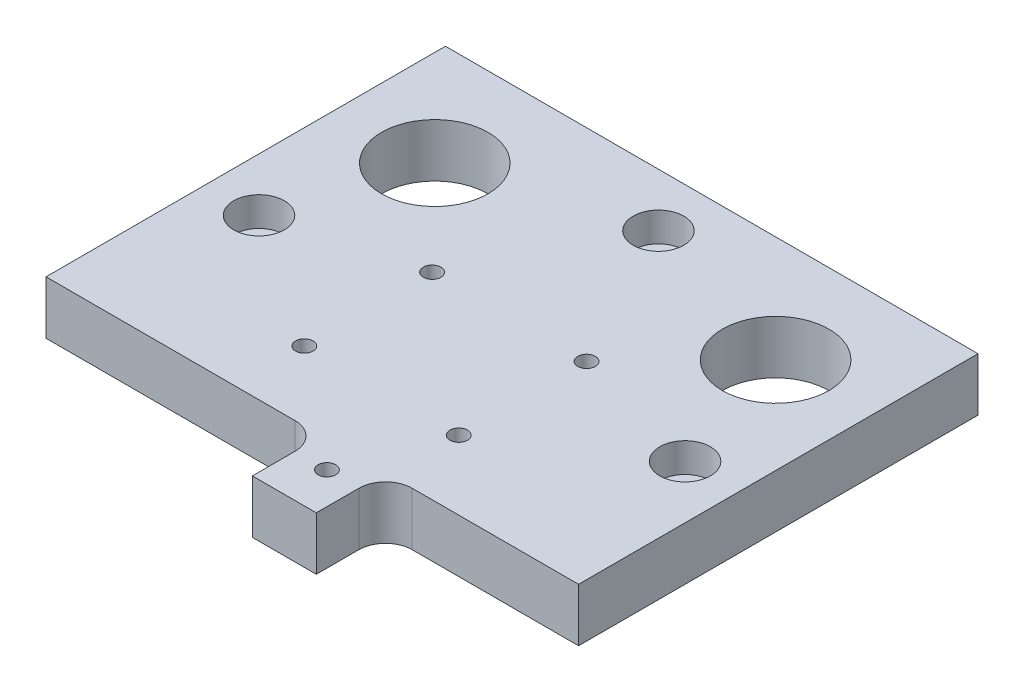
ISO-10303-21;
HEADER;
FILE_DESCRIPTION(('STEP AP214'),'2;1');
FILE_NAME('part.step','',(''),(''),'','','');
FILE_SCHEMA(('AUTOMOTIVE_DESIGN { 1 0 10303 214 1 1 1 1 }'));
ENDSEC;
DATA;
#1=APPLICATION_CONTEXT('core data for automotive mechanical design processes');
#2=APPLICATION_PROTOCOL_DEFINITION('international standard','automotive_design',2000,#1);
#3=PRODUCT_CONTEXT('',#1,'mechanical');
#4=PRODUCT('Part','Part','',(#3));
#5=PRODUCT_RELATED_PRODUCT_CATEGORY('part','',(#4));
#6=PRODUCT_DEFINITION_FORMATION('','',#4);
#7=PRODUCT_DEFINITION_CONTEXT('part definition',#1,'design');
#8=PRODUCT_DEFINITION('design','',#6,#7);
#9=PRODUCT_DEFINITION_SHAPE('','',#8);
#10=(LENGTH_UNIT() NAMED_UNIT(*) SI_UNIT(.MILLI.,.METRE.));
#11=(NAMED_UNIT(*) PLANE_ANGLE_UNIT() SI_UNIT($,.RADIAN.));
#12=(NAMED_UNIT(*) SI_UNIT($,.STERADIAN.) SOLID_ANGLE_UNIT());
#13=UNCERTAINTY_MEASURE_WITH_UNIT(LENGTH_MEASURE(1.E-05),#10,'distance_accuracy_value','');
#14=(GEOMETRIC_REPRESENTATION_CONTEXT(3) GLOBAL_UNCERTAINTY_ASSIGNED_CONTEXT((#13)) GLOBAL_UNIT_ASSIGNED_CONTEXT((#10,
#11,#12)) REPRESENTATION_CONTEXT('',''));
#15=CARTESIAN_POINT('',(0.,0.,0.));
#16=DIRECTION('',(0.,0.,1.));
#17=DIRECTION('',(1.,0.,0.));
#18=AXIS2_PLACEMENT_3D('',#15,#16,#17);
#19=CARTESIAN_POINT('',(90.,-78.,45.));
#20=DIRECTION('',(0.,1.,0.));
#21=DIRECTION('',(0.,0.,1.));
#22=AXIS2_PLACEMENT_3D('',#19,#20,#21);
#23=CYLINDRICAL_SURFACE('',#22,2.75);
#24=CARTESIAN_POINT('',(90.,0.,45.));
#25=DIRECTION('',(0.,1.,0.));
#26=DIRECTION('',(0.,0.,1.));
#27=AXIS2_PLACEMENT_3D('',#24,#25,#26);
#28=CIRCLE('',#27,2.75);
#29=CARTESIAN_POINT('',(90.,0.,47.75));
#30=VERTEX_POINT('',#29);
#31=EDGE_CURVE('E195',#30,#30,#28,.T.);
#32=ORIENTED_EDGE('',*,*,#31,.F.);
#33=EDGE_LOOP('',(#32));
#34=FACE_BOUND('',#33,.T.);
#35=CARTESIAN_POINT('',(90.,4.5,45.));
#36=DIRECTION('',(0.,1.,0.));
#37=DIRECTION('',(0.,0.,1.));
#38=AXIS2_PLACEMENT_3D('',#35,#36,#37);
#39=CIRCLE('',#38,2.75);
#40=CARTESIAN_POINT('',(90.,4.5,47.75));
#41=VERTEX_POINT('',#40);
#42=EDGE_CURVE('E37',#41,#41,#39,.F.);
#43=ORIENTED_EDGE('',*,*,#42,.F.);
#44=EDGE_LOOP('',(#43));
#45=FACE_BOUND('',#44,.T.);
#46=ADVANCED_FACE('F33',(#34,#45),#23,.F.);
#47=CARTESIAN_POINT('',(10.,-78.,45.));
#48=DIRECTION('',(0.,1.,0.));
#49=DIRECTION('',(0.,0.,1.));
#50=AXIS2_PLACEMENT_3D('',#47,#48,#49);
#51=CYLINDRICAL_SURFACE('',#50,2.75);
#52=CARTESIAN_POINT('',(10.,0.,45.));
#53=DIRECTION('',(0.,1.,0.));
#54=DIRECTION('',(0.,0.,1.));
#55=AXIS2_PLACEMENT_3D('',#52,#53,#54);
#56=CIRCLE('',#55,2.75);
#57=CARTESIAN_POINT('',(10.,0.,47.75));
#58=VERTEX_POINT('',#57);
#59=EDGE_CURVE('E198',#58,#58,#56,.T.);
#60=ORIENTED_EDGE('',*,*,#59,.F.);
#61=EDGE_LOOP('',(#60));
#62=FACE_BOUND('',#61,.T.);
#63=CARTESIAN_POINT('',(10.,4.5,45.));
#64=DIRECTION('',(0.,1.,0.));
#65=DIRECTION('',(0.,0.,1.));
#66=AXIS2_PLACEMENT_3D('',#63,#64,#65);
#67=CIRCLE('',#66,2.75);
#68=CARTESIAN_POINT('',(10.,4.5,47.75));
#69=VERTEX_POINT('',#68);
#70=EDGE_CURVE('E246',#69,#69,#67,.F.);
#71=ORIENTED_EDGE('',*,*,#70,.F.);
#72=EDGE_LOOP('',(#71));
#73=FACE_BOUND('',#72,.T.);
#74=ADVANCED_FACE('F341',(#62,#73),#51,.F.);
#75=CARTESIAN_POINT('',(50.,-78.,10.));
#76=DIRECTION('',(0.,1.,0.));
#77=DIRECTION('',(0.,0.,1.));
#78=AXIS2_PLACEMENT_3D('',#75,#76,#77);
#79=CYLINDRICAL_SURFACE('',#78,2.75);
#80=CARTESIAN_POINT('',(50.,0.,10.));
#81=DIRECTION('',(0.,1.,0.));
#82=DIRECTION('',(0.,0.,1.));
#83=AXIS2_PLACEMENT_3D('',#80,#81,#82);
#84=CIRCLE('',#83,2.75);
#85=CARTESIAN_POINT('',(50.,0.,12.75));
#86=VERTEX_POINT('',#85);
#87=EDGE_CURVE('E201',#86,#86,#84,.T.);
#88=ORIENTED_EDGE('',*,*,#87,.F.);
#89=EDGE_LOOP('',(#88));
#90=FACE_BOUND('',#89,.T.);
#91=CARTESIAN_POINT('',(50.,4.5,10.));
#92=DIRECTION('',(0.,1.,0.));
#93=DIRECTION('',(0.,0.,1.));
#94=AXIS2_PLACEMENT_3D('',#91,#92,#93);
#95=CIRCLE('',#94,2.75);
#96=CARTESIAN_POINT('',(50.,4.5,12.75));
#97=VERTEX_POINT('',#96);
#98=EDGE_CURVE('E137',#97,#97,#95,.F.);
#99=ORIENTED_EDGE('',*,*,#98,.F.);
#100=EDGE_LOOP('',(#99));
#101=FACE_BOUND('',#100,.T.);
#102=ADVANCED_FACE('F347',(#90,#101),#79,.F.);
#103=CARTESIAN_POINT('',(0.,0.,88.));
#104=DIRECTION('',(1.,0.,0.));
#105=DIRECTION('',(0.,0.,-1.));
#106=AXIS2_PLACEMENT_3D('',#103,#104,#105);
#107=PLANE('',#106);
#108=DIRECTION('',(0.,1.,0.));
#109=VECTOR('',#108,1.);
#110=CARTESIAN_POINT('',(0.,-78.,75.));
#111=LINE('',#110,#109);
#112=CARTESIAN_POINT('',(0.,0.,75.));
#113=VERTEX_POINT('',#112);
#114=CARTESIAN_POINT('',(0.,10.,75.));
#115=VERTEX_POINT('',#114);
#116=EDGE_CURVE('E122',#113,#115,#111,.T.);
#117=ORIENTED_EDGE('',*,*,#116,.T.);
#118=DIRECTION('',(0.,0.,-1.));
#119=VECTOR('',#118,1.);
#120=CARTESIAN_POINT('',(0.,10.,88.));
#121=LINE('',#120,#119);
#122=CARTESIAN_POINT('',(0.,10.,0.));
#123=VERTEX_POINT('',#122);
#124=EDGE_CURVE('E136',#115,#123,#121,.T.);
#125=ORIENTED_EDGE('',*,*,#124,.T.);
#126=DIRECTION('',(0.,-1.,0.));
#127=VECTOR('',#126,1.);
#128=CARTESIAN_POINT('',(0.,0.,0.));
#129=LINE('',#128,#127);
#130=CARTESIAN_POINT('',(0.,0.,0.));
#131=VERTEX_POINT('',#130);
#132=EDGE_CURVE('E222',#123,#131,#129,.T.);
#133=ORIENTED_EDGE('',*,*,#132,.T.);
#134=DIRECTION('',(0.,0.,-1.));
#135=VECTOR('',#134,1.);
#136=CARTESIAN_POINT('',(0.,0.,88.));
#137=LINE('',#136,#135);
#138=EDGE_CURVE('E244',#113,#131,#137,.T.);
#139=ORIENTED_EDGE('',*,*,#138,.F.);
#140=EDGE_LOOP('',(#117,#125,#133,#139));
#141=FACE_BOUND('',#140,.T.);
#142=ADVANCED_FACE('F35',(#141),#107,.F.);
#143=CARTESIAN_POINT('',(0.,0.,88.));
#144=DIRECTION('',(0.,1.,0.));
#145=DIRECTION('',(0.,0.,1.));
#146=AXIS2_PLACEMENT_3D('',#143,#144,#145);
#147=PLANE('',#146);
#148=CARTESIAN_POINT('',(56.9975000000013,0.,45.));
#149=DIRECTION('',(0.,-1.,0.));
#150=DIRECTION('',(0.,0.,-1.));
#151=AXIS2_PLACEMENT_3D('',#148,#149,#150);
#152=CIRCLE('',#151,3.25000000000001);
#153=CARTESIAN_POINT('',(56.9975000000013,0.,41.75));
#154=VERTEX_POINT('',#153);
#155=EDGE_CURVE('E620',#154,#154,#152,.T.);
#156=ORIENTED_EDGE('',*,*,#155,.F.);
#157=EDGE_LOOP('',(#156));
#158=FACE_BOUND('',#157,.T.);
#159=CARTESIAN_POINT('',(39.4975000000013,0.,45.));
#160=DIRECTION('',(0.,-1.,0.));
#161=DIRECTION('',(0.,0.,-1.));
#162=AXIS2_PLACEMENT_3D('',#159,#160,#161);
#163=CIRCLE('',#162,3.25);
#164=CARTESIAN_POINT('',(39.4975000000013,0.,41.75));
#165=VERTEX_POINT('',#164);
#166=EDGE_CURVE('E619',#165,#165,#163,.T.);
#167=ORIENTED_EDGE('',*,*,#166,.F.);
#168=EDGE_LOOP('',(#167));
#169=FACE_BOUND('',#168,.T.);
#170=CARTESIAN_POINT('',(35.5,0.,62.));
#171=DIRECTION('',(0.,1.,0.));
#172=DIRECTION('',(0.,0.,1.));
#173=AXIS2_PLACEMENT_3D('',#170,#171,#172);
#174=CIRCLE('',#173,1.65);
#175=CARTESIAN_POINT('',(35.5,0.,63.65));
#176=VERTEX_POINT('',#175);
#177=EDGE_CURVE('E174',#176,#176,#174,.T.);
#178=ORIENTED_EDGE('',*,*,#177,.T.);
#179=EDGE_LOOP('',(#178));
#180=FACE_BOUND('',#179,.T.);
#181=CARTESIAN_POINT('',(35.5,0.,38.));
#182=DIRECTION('',(0.,1.,0.));
#183=DIRECTION('',(0.,0.,1.));
#184=AXIS2_PLACEMENT_3D('',#181,#182,#183);
#185=CIRCLE('',#184,1.65);
#186=CARTESIAN_POINT('',(35.5,0.,39.65));
#187=VERTEX_POINT('',#186);
#188=EDGE_CURVE('E180',#187,#187,#185,.T.);
#189=ORIENTED_EDGE('',*,*,#188,.T.);
#190=EDGE_LOOP('',(#189));
#191=FACE_BOUND('',#190,.T.);
#192=CARTESIAN_POINT('',(64.5,0.,38.));
#193=DIRECTION('',(0.,1.,0.));
#194=DIRECTION('',(0.,0.,1.));
#195=AXIS2_PLACEMENT_3D('',#192,#193,#194);
#196=CIRCLE('',#195,1.65);
#197=CARTESIAN_POINT('',(64.5,0.,39.65));
#198=VERTEX_POINT('',#197);
#199=EDGE_CURVE('E186',#198,#198,#196,.T.);
#200=ORIENTED_EDGE('',*,*,#199,.T.);
#201=EDGE_LOOP('',(#200));
#202=FACE_BOUND('',#201,.T.);
#203=CARTESIAN_POINT('',(64.5,0.,62.));
#204=DIRECTION('',(0.,1.,0.));
#205=DIRECTION('',(0.,0.,1.));
#206=AXIS2_PLACEMENT_3D('',#203,#204,#205);
#207=CIRCLE('',#206,1.65);
#208=CARTESIAN_POINT('',(64.5,0.,63.65));
#209=VERTEX_POINT('',#208);
#210=EDGE_CURVE('E192',#209,#209,#207,.T.);
#211=ORIENTED_EDGE('',*,*,#210,.T.);
#212=EDGE_LOOP('',(#211));
#213=FACE_BOUND('',#212,.T.);
#214=ORIENTED_EDGE('',*,*,#31,.T.);
#215=EDGE_LOOP('',(#214));
#216=FACE_BOUND('',#215,.T.);
#217=ORIENTED_EDGE('',*,*,#59,.T.);
#218=EDGE_LOOP('',(#217));
#219=FACE_BOUND('',#218,.T.);
#220=ORIENTED_EDGE('',*,*,#87,.T.);
#221=EDGE_LOOP('',(#220));
#222=FACE_BOUND('',#221,.T.);
#223=CARTESIAN_POINT('',(57.75,0.,80.));
#224=DIRECTION('',(0.,1.,0.));
#225=DIRECTION('',(0.,0.,1.));
#226=AXIS2_PLACEMENT_3D('',#223,#224,#225);
#227=CIRCLE('',#226,1.65);
#228=CARTESIAN_POINT('',(57.75,0.,81.65));
#229=VERTEX_POINT('',#228);
#230=EDGE_CURVE('E207',#229,#229,#227,.T.);
#231=ORIENTED_EDGE('',*,*,#230,.T.);
#232=EDGE_LOOP('',(#231));
#233=FACE_BOUND('',#232,.T.);
#234=CARTESIAN_POINT('',(82.,0.,20.));
#235=DIRECTION('',(0.,1.,0.));
#236=DIRECTION('',(0.,0.,1.));
#237=AXIS2_PLACEMENT_3D('',#234,#235,#236);
#238=CIRCLE('',#237,9.99999999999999);
#239=CARTESIAN_POINT('',(82.,0.,30.));
#240=VERTEX_POINT('',#239);
#241=EDGE_CURVE('E213',#240,#240,#238,.T.);
#242=ORIENTED_EDGE('',*,*,#241,.T.);
#243=EDGE_LOOP('',(#242));
#244=FACE_BOUND('',#243,.T.);
#245=CARTESIAN_POINT('',(18.,0.,20.));
#246=DIRECTION('',(0.,1.,0.));
#247=DIRECTION('',(0.,0.,1.));
#248=AXIS2_PLACEMENT_3D('',#245,#246,#247);
#249=CIRCLE('',#248,10.);
#250=CARTESIAN_POINT('',(18.,0.,30.));
#251=VERTEX_POINT('',#250);
#252=EDGE_CURVE('E219',#251,#251,#249,.T.);
#253=ORIENTED_EDGE('',*,*,#252,.T.);
#254=EDGE_LOOP('',(#253));
#255=FACE_BOUND('',#254,.T.);
#256=DIRECTION('',(1.,0.,0.));
#257=VECTOR('',#256,1.);
#258=CARTESIAN_POINT('',(0.,0.,75.));
#259=LINE('',#258,#257);
#260=CARTESIAN_POINT('',(68.75,0.,75.));
#261=VERTEX_POINT('',#260);
#262=CARTESIAN_POINT('',(100.,0.,75.));
#263=VERTEX_POINT('',#262);
#264=EDGE_CURVE('E169',#261,#263,#259,.T.);
#265=ORIENTED_EDGE('',*,*,#264,.F.);
#266=CARTESIAN_POINT('',(68.75,0.,80.));
#267=DIRECTION('',(0.,1.,0.));
#268=DIRECTION('',(0.,0.,1.));
#269=AXIS2_PLACEMENT_3D('',#266,#267,#268);
#270=CIRCLE('',#269,5.);
#271=CARTESIAN_POINT('',(63.75,0.,80.));
#272=VERTEX_POINT('',#271);
#273=EDGE_CURVE('E167',#272,#261,#270,.F.);
#274=ORIENTED_EDGE('',*,*,#273,.F.);
#275=DIRECTION('',(0.,0.,-1.));
#276=VECTOR('',#275,1.);
#277=CARTESIAN_POINT('',(63.75,0.,88.));
#278=LINE('',#277,#276);
#279=CARTESIAN_POINT('',(63.75,0.,88.));
#280=VERTEX_POINT('',#279);
#281=EDGE_CURVE('E162',#280,#272,#278,.T.);
#282=ORIENTED_EDGE('',*,*,#281,.F.);
#283=DIRECTION('',(1.,0.,0.));
#284=VECTOR('',#283,1.);
#285=CARTESIAN_POINT('',(0.,0.,88.));
#286=LINE('',#285,#284);
#287=CARTESIAN_POINT('',(51.75,0.,88.));
#288=VERTEX_POINT('',#287);
#289=EDGE_CURVE('E223',#288,#280,#286,.T.);
#290=ORIENTED_EDGE('',*,*,#289,.F.);
#291=DIRECTION('',(0.,0.,1.));
#292=VECTOR('',#291,1.);
#293=CARTESIAN_POINT('',(51.75,0.,88.));
#294=LINE('',#293,#292);
#295=CARTESIAN_POINT('',(51.75,0.,80.));
#296=VERTEX_POINT('',#295);
#297=EDGE_CURVE('E57',#296,#288,#294,.T.);
#298=ORIENTED_EDGE('',*,*,#297,.F.);
#299=CARTESIAN_POINT('',(46.75,0.,80.));
#300=DIRECTION('',(0.,1.,0.));
#301=DIRECTION('',(0.,0.,1.));
#302=AXIS2_PLACEMENT_3D('',#299,#300,#301);
#303=CIRCLE('',#302,5.);
#304=CARTESIAN_POINT('',(46.75,0.,75.));
#305=VERTEX_POINT('',#304);
#306=EDGE_CURVE('E165',#305,#296,#303,.F.);
#307=ORIENTED_EDGE('',*,*,#306,.F.);
#308=DIRECTION('',(1.,0.,0.));
#309=VECTOR('',#308,1.);
#310=CARTESIAN_POINT('',(0.,0.,75.));
#311=LINE('',#310,#309);
#312=EDGE_CURVE('E118',#113,#305,#311,.T.);
#313=ORIENTED_EDGE('',*,*,#312,.F.);
#314=ORIENTED_EDGE('',*,*,#138,.T.);
#315=DIRECTION('',(1.,0.,0.));
#316=VECTOR('',#315,1.);
#317=CARTESIAN_POINT('',(0.,0.,0.));
#318=LINE('',#317,#316);
#319=CARTESIAN_POINT('',(100.,0.,0.));
#320=VERTEX_POINT('',#319);
#321=EDGE_CURVE('E232',#131,#320,#318,.T.);
#322=ORIENTED_EDGE('',*,*,#321,.T.);
#323=DIRECTION('',(0.,0.,-1.));
#324=VECTOR('',#323,1.);
#325=CARTESIAN_POINT('',(100.,0.,88.));
#326=LINE('',#325,#324);
#327=EDGE_CURVE('E242',#263,#320,#326,.T.);
#328=ORIENTED_EDGE('',*,*,#327,.F.);
#329=EDGE_LOOP('',(#265,#274,#282,#290,#298,#307,#313,#314,#322,#328));
#330=FACE_BOUND('',#329,.T.);
#331=ADVANCED_FACE('F303',(#158,#169,#180,#191,#202,#213,#216,#219,#222,#233,#244,#255,#330),
#147,.F.);
#332=CARTESIAN_POINT('',(100.,0.,88.));
#333=DIRECTION('',(-1.,0.,0.));
#334=DIRECTION('',(0.,0.,1.));
#335=AXIS2_PLACEMENT_3D('',#332,#333,#334);
#336=PLANE('',#335);
#337=DIRECTION('',(0.,1.,0.));
#338=VECTOR('',#337,1.);
#339=CARTESIAN_POINT('',(100.,-78.,75.));
#340=LINE('',#339,#338);
#341=CARTESIAN_POINT('',(100.,10.,75.));
#342=VERTEX_POINT('',#341);
#343=EDGE_CURVE('E153',#263,#342,#340,.T.);
#344=ORIENTED_EDGE('',*,*,#343,.F.);
#345=ORIENTED_EDGE('',*,*,#327,.T.);
#346=DIRECTION('',(0.,1.,0.));
#347=VECTOR('',#346,1.);
#348=CARTESIAN_POINT('',(100.,0.,0.));
#349=LINE('',#348,#347);
#350=CARTESIAN_POINT('',(100.,10.,0.));
#351=VERTEX_POINT('',#350);
#352=EDGE_CURVE('E235',#320,#351,#349,.T.);
#353=ORIENTED_EDGE('',*,*,#352,.T.);
#354=DIRECTION('',(0.,0.,-1.));
#355=VECTOR('',#354,1.);
#356=CARTESIAN_POINT('',(100.,10.,88.));
#357=LINE('',#356,#355);
#358=EDGE_CURVE('E240',#342,#351,#357,.T.);
#359=ORIENTED_EDGE('',*,*,#358,.F.);
#360=EDGE_LOOP('',(#344,#345,#353,#359));
#361=FACE_BOUND('',#360,.T.);
#362=ADVANCED_FACE('F278',(#361),#336,.F.);
#363=CARTESIAN_POINT('',(0.,10.,88.));
#364=DIRECTION('',(0.,-1.,0.));
#365=DIRECTION('',(0.,0.,-1.));
#366=AXIS2_PLACEMENT_3D('',#363,#364,#365);
#367=PLANE('',#366);
#368=CARTESIAN_POINT('',(90.,10.,45.));
#369=DIRECTION('',(0.,1.,0.));
#370=DIRECTION('',(0.,0.,1.));
#371=AXIS2_PLACEMENT_3D('',#368,#369,#370);
#372=CIRCLE('',#371,4.75);
#373=CARTESIAN_POINT('',(90.,10.,49.75));
#374=VERTEX_POINT('',#373);
#375=EDGE_CURVE('E260',#374,#374,#372,.T.);
#376=ORIENTED_EDGE('',*,*,#375,.F.);
#377=EDGE_LOOP('',(#376));
#378=FACE_BOUND('',#377,.T.);
#379=CARTESIAN_POINT('',(10.,10.,45.));
#380=DIRECTION('',(0.,1.,0.));
#381=DIRECTION('',(0.,0.,1.));
#382=AXIS2_PLACEMENT_3D('',#379,#380,#381);
#383=CIRCLE('',#382,4.75);
#384=CARTESIAN_POINT('',(10.,10.,49.75));
#385=VERTEX_POINT('',#384);
#386=EDGE_CURVE('E253',#385,#385,#383,.T.);
#387=ORIENTED_EDGE('',*,*,#386,.F.);
#388=EDGE_LOOP('',(#387));
#389=FACE_BOUND('',#388,.T.);
#390=CARTESIAN_POINT('',(50.,10.,10.));
#391=DIRECTION('',(0.,1.,0.));
#392=DIRECTION('',(0.,0.,1.));
#393=AXIS2_PLACEMENT_3D('',#390,#391,#392);
#394=CIRCLE('',#393,4.75);
#395=CARTESIAN_POINT('',(50.,10.,14.75));
#396=VERTEX_POINT('',#395);
#397=EDGE_CURVE('E143',#396,#396,#394,.T.);
#398=ORIENTED_EDGE('',*,*,#397,.F.);
#399=EDGE_LOOP('',(#398));
#400=FACE_BOUND('',#399,.T.);
#401=CARTESIAN_POINT('',(35.5,10.,62.));
#402=DIRECTION('',(0.,1.,0.));
#403=DIRECTION('',(0.,0.,1.));
#404=AXIS2_PLACEMENT_3D('',#401,#402,#403);
#405=CIRCLE('',#404,1.65);
#406=CARTESIAN_POINT('',(35.5,10.,63.65));
#407=VERTEX_POINT('',#406);
#408=EDGE_CURVE('E171',#407,#407,#405,.T.);
#409=ORIENTED_EDGE('',*,*,#408,.F.);
#410=EDGE_LOOP('',(#409));
#411=FACE_BOUND('',#410,.T.);
#412=CARTESIAN_POINT('',(35.5,10.,38.));
#413=DIRECTION('',(0.,1.,0.));
#414=DIRECTION('',(0.,0.,1.));
#415=AXIS2_PLACEMENT_3D('',#412,#413,#414);
#416=CIRCLE('',#415,1.65);
#417=CARTESIAN_POINT('',(35.5,10.,39.65));
#418=VERTEX_POINT('',#417);
#419=EDGE_CURVE('E177',#418,#418,#416,.T.);
#420=ORIENTED_EDGE('',*,*,#419,.F.);
#421=EDGE_LOOP('',(#420));
#422=FACE_BOUND('',#421,.T.);
#423=CARTESIAN_POINT('',(64.5,10.,38.));
#424=DIRECTION('',(0.,1.,0.));
#425=DIRECTION('',(0.,0.,1.));
#426=AXIS2_PLACEMENT_3D('',#423,#424,#425);
#427=CIRCLE('',#426,1.65);
#428=CARTESIAN_POINT('',(64.5,10.,39.65));
#429=VERTEX_POINT('',#428);
#430=EDGE_CURVE('E183',#429,#429,#427,.T.);
#431=ORIENTED_EDGE('',*,*,#430,.F.);
#432=EDGE_LOOP('',(#431));
#433=FACE_BOUND('',#432,.T.);
#434=CARTESIAN_POINT('',(64.5,10.,62.));
#435=DIRECTION('',(0.,1.,0.));
#436=DIRECTION('',(0.,0.,1.));
#437=AXIS2_PLACEMENT_3D('',#434,#435,#436);
#438=CIRCLE('',#437,1.65);
#439=CARTESIAN_POINT('',(64.5,10.,63.65));
#440=VERTEX_POINT('',#439);
#441=EDGE_CURVE('E189',#440,#440,#438,.T.);
#442=ORIENTED_EDGE('',*,*,#441,.F.);
#443=EDGE_LOOP('',(#442));
#444=FACE_BOUND('',#443,.T.);
#445=CARTESIAN_POINT('',(57.75,10.,80.));
#446=DIRECTION('',(0.,1.,0.));
#447=DIRECTION('',(0.,0.,1.));
#448=AXIS2_PLACEMENT_3D('',#445,#446,#447);
#449=CIRCLE('',#448,1.65);
#450=CARTESIAN_POINT('',(57.75,10.,81.65));
#451=VERTEX_POINT('',#450);
#452=EDGE_CURVE('E204',#451,#451,#449,.T.);
#453=ORIENTED_EDGE('',*,*,#452,.F.);
#454=EDGE_LOOP('',(#453));
#455=FACE_BOUND('',#454,.T.);
#456=CARTESIAN_POINT('',(82.,10.,20.));
#457=DIRECTION('',(0.,1.,0.));
#458=DIRECTION('',(0.,0.,1.));
#459=AXIS2_PLACEMENT_3D('',#456,#457,#458);
#460=CIRCLE('',#459,9.99999999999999);
#461=CARTESIAN_POINT('',(82.,10.,30.));
#462=VERTEX_POINT('',#461);
#463=EDGE_CURVE('E210',#462,#462,#460,.T.);
#464=ORIENTED_EDGE('',*,*,#463,.F.);
#465=EDGE_LOOP('',(#464));
#466=FACE_BOUND('',#465,.T.);
#467=CARTESIAN_POINT('',(18.,10.,20.));
#468=DIRECTION('',(0.,1.,0.));
#469=DIRECTION('',(0.,0.,1.));
#470=AXIS2_PLACEMENT_3D('',#467,#468,#469);
#471=CIRCLE('',#470,10.);
#472=CARTESIAN_POINT('',(18.,10.,30.));
#473=VERTEX_POINT('',#472);
#474=EDGE_CURVE('E216',#473,#473,#471,.T.);
#475=ORIENTED_EDGE('',*,*,#474,.F.);
#476=EDGE_LOOP('',(#475));
#477=FACE_BOUND('',#476,.T.);
#478=DIRECTION('',(1.,0.,0.));
#479=VECTOR('',#478,1.);
#480=CARTESIAN_POINT('',(68.75,10.,75.));
#481=LINE('',#480,#479);
#482=CARTESIAN_POINT('',(68.75,10.,75.));
#483=VERTEX_POINT('',#482);
#484=EDGE_CURVE('E151',#483,#342,#481,.T.);
#485=ORIENTED_EDGE('',*,*,#484,.T.);
#486=ORIENTED_EDGE('',*,*,#358,.T.);
#487=DIRECTION('',(-1.,0.,0.));
#488=VECTOR('',#487,1.);
#489=CARTESIAN_POINT('',(0.,10.,0.));
#490=LINE('',#489,#488);
#491=EDGE_CURVE('E227',#351,#123,#490,.T.);
#492=ORIENTED_EDGE('',*,*,#491,.T.);
#493=ORIENTED_EDGE('',*,*,#124,.F.);
#494=DIRECTION('',(1.,0.,0.));
#495=VECTOR('',#494,1.);
#496=CARTESIAN_POINT('',(0.,10.,75.));
#497=LINE('',#496,#495);
#498=CARTESIAN_POINT('',(46.75,10.,75.));
#499=VERTEX_POINT('',#498);
#500=EDGE_CURVE('E115',#115,#499,#497,.T.);
#501=ORIENTED_EDGE('',*,*,#500,.T.);
#502=CARTESIAN_POINT('',(46.75,10.,80.));
#503=DIRECTION('',(0.,-1.,0.));
#504=DIRECTION('',(0.,0.,1.));
#505=AXIS2_PLACEMENT_3D('',#502,#503,#504);
#506=CIRCLE('',#505,5.);
#507=CARTESIAN_POINT('',(51.75,10.,80.));
#508=VERTEX_POINT('',#507);
#509=EDGE_CURVE('E125',#499,#508,#506,.T.);
#510=ORIENTED_EDGE('',*,*,#509,.T.);
#511=DIRECTION('',(0.,0.,1.));
#512=VECTOR('',#511,1.);
#513=CARTESIAN_POINT('',(51.75,10.,88.));
#514=LINE('',#513,#512);
#515=CARTESIAN_POINT('',(51.75,10.,88.));
#516=VERTEX_POINT('',#515);
#517=EDGE_CURVE('E130',#508,#516,#514,.T.);
#518=ORIENTED_EDGE('',*,*,#517,.T.);
#519=DIRECTION('',(-1.,0.,0.));
#520=VECTOR('',#519,1.);
#521=CARTESIAN_POINT('',(0.,10.,88.));
#522=LINE('',#521,#520);
#523=CARTESIAN_POINT('',(63.75,10.,88.));
#524=VERTEX_POINT('',#523);
#525=EDGE_CURVE('E226',#524,#516,#522,.T.);
#526=ORIENTED_EDGE('',*,*,#525,.F.);
#527=DIRECTION('',(0.,0.,-1.));
#528=VECTOR('',#527,1.);
#529=CARTESIAN_POINT('',(63.75,10.,88.));
#530=LINE('',#529,#528);
#531=CARTESIAN_POINT('',(63.75,10.,80.));
#532=VERTEX_POINT('',#531);
#533=EDGE_CURVE('E49',#524,#532,#530,.T.);
#534=ORIENTED_EDGE('',*,*,#533,.T.);
#535=CARTESIAN_POINT('',(68.75,10.,80.));
#536=DIRECTION('',(0.,-1.,0.));
#537=DIRECTION('',(0.,0.,1.));
#538=AXIS2_PLACEMENT_3D('',#535,#536,#537);
#539=CIRCLE('',#538,5.);
#540=EDGE_CURVE('E148',#532,#483,#539,.T.);
#541=ORIENTED_EDGE('',*,*,#540,.T.);
#542=EDGE_LOOP('',(#485,#486,#492,#493,#501,#510,#518,#526,#534,#541));
#543=FACE_BOUND('',#542,.T.);
#544=ADVANCED_FACE('F134',(#378,#389,#400,#411,#422,#433,#444,#455,#466,#477,#543),#367,.F.);
#545=CARTESIAN_POINT('',(0.,10.,88.));
#546=DIRECTION('',(0.,0.,-1.));
#547=DIRECTION('',(-1.,0.,0.));
#548=AXIS2_PLACEMENT_3D('',#545,#546,#547);
#549=PLANE('',#548);
#550=DIRECTION('',(0.,-1.,0.));
#551=VECTOR('',#550,1.);
#552=CARTESIAN_POINT('',(63.75,10.,88.));
#553=LINE('',#552,#551);
#554=EDGE_CURVE('E12',#524,#280,#553,.T.);
#555=ORIENTED_EDGE('',*,*,#554,.F.);
#556=ORIENTED_EDGE('',*,*,#525,.T.);
#557=DIRECTION('',(0.,1.,0.));
#558=VECTOR('',#557,1.);
#559=CARTESIAN_POINT('',(51.75,10.,88.));
#560=LINE('',#559,#558);
#561=EDGE_CURVE('E42',#288,#516,#560,.T.);
#562=ORIENTED_EDGE('',*,*,#561,.F.);
#563=ORIENTED_EDGE('',*,*,#289,.T.);
#564=EDGE_LOOP('',(#555,#556,#562,#563));
#565=FACE_BOUND('',#564,.T.);
#566=ADVANCED_FACE('F277',(#565),#549,.F.);
#567=CARTESIAN_POINT('',(0.,10.,0.));
#568=DIRECTION('',(0.,0.,-1.));
#569=DIRECTION('',(-1.,0.,0.));
#570=AXIS2_PLACEMENT_3D('',#567,#568,#569);
#571=PLANE('',#570);
#572=ORIENTED_EDGE('',*,*,#132,.F.);
#573=ORIENTED_EDGE('',*,*,#491,.F.);
#574=ORIENTED_EDGE('',*,*,#352,.F.);
#575=ORIENTED_EDGE('',*,*,#321,.F.);
#576=EDGE_LOOP('',(#572,#573,#574,#575));
#577=FACE_BOUND('',#576,.T.);
#578=ADVANCED_FACE('F299',(#577),#571,.T.);
#579=CARTESIAN_POINT('',(18.,-78.,20.));
#580=DIRECTION('',(0.,1.,0.));
#581=DIRECTION('',(0.,0.,1.));
#582=AXIS2_PLACEMENT_3D('',#579,#580,#581);
#583=CYLINDRICAL_SURFACE('',#582,10.);
#584=ORIENTED_EDGE('',*,*,#474,.T.);
#585=EDGE_LOOP('',(#584));
#586=FACE_BOUND('',#585,.T.);
#587=ORIENTED_EDGE('',*,*,#252,.F.);
#588=EDGE_LOOP('',(#587));
#589=FACE_BOUND('',#588,.T.);
#590=ADVANCED_FACE('F295',(#586,#589),#583,.F.);
#591=CARTESIAN_POINT('',(82.,-78.,20.));
#592=DIRECTION('',(0.,1.,0.));
#593=DIRECTION('',(0.,0.,1.));
#594=AXIS2_PLACEMENT_3D('',#591,#592,#593);
#595=CYLINDRICAL_SURFACE('',#594,9.99999999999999);
#596=ORIENTED_EDGE('',*,*,#463,.T.);
#597=EDGE_LOOP('',(#596));
#598=FACE_BOUND('',#597,.T.);
#599=ORIENTED_EDGE('',*,*,#241,.F.);
#600=EDGE_LOOP('',(#599));
#601=FACE_BOUND('',#600,.T.);
#602=ADVANCED_FACE('F298',(#598,#601),#595,.F.);
#603=CARTESIAN_POINT('',(57.75,-78.,80.));
#604=DIRECTION('',(0.,1.,0.));
#605=DIRECTION('',(0.,0.,1.));
#606=AXIS2_PLACEMENT_3D('',#603,#604,#605);
#607=CYLINDRICAL_SURFACE('',#606,1.65);
#608=ORIENTED_EDGE('',*,*,#452,.T.);
#609=EDGE_LOOP('',(#608));
#610=FACE_BOUND('',#609,.T.);
#611=ORIENTED_EDGE('',*,*,#230,.F.);
#612=EDGE_LOOP('',(#611));
#613=FACE_BOUND('',#612,.T.);
#614=ADVANCED_FACE('F359',(#610,#613),#607,.F.);
#615=CARTESIAN_POINT('',(64.5,-78.,62.));
#616=DIRECTION('',(0.,1.,0.));
#617=DIRECTION('',(0.,0.,1.));
#618=AXIS2_PLACEMENT_3D('',#615,#616,#617);
#619=CYLINDRICAL_SURFACE('',#618,1.65);
#620=ORIENTED_EDGE('',*,*,#441,.T.);
#621=EDGE_LOOP('',(#620));
#622=FACE_BOUND('',#621,.T.);
#623=ORIENTED_EDGE('',*,*,#210,.F.);
#624=EDGE_LOOP('',(#623));
#625=FACE_BOUND('',#624,.T.);
#626=ADVANCED_FACE('F353',(#622,#625),#619,.F.);
#627=CARTESIAN_POINT('',(64.5,-78.,38.));
#628=DIRECTION('',(0.,1.,0.));
#629=DIRECTION('',(0.,0.,1.));
#630=AXIS2_PLACEMENT_3D('',#627,#628,#629);
#631=CYLINDRICAL_SURFACE('',#630,1.65);
#632=ORIENTED_EDGE('',*,*,#430,.T.);
#633=EDGE_LOOP('',(#632));
#634=FACE_BOUND('',#633,.T.);
#635=ORIENTED_EDGE('',*,*,#199,.F.);
#636=EDGE_LOOP('',(#635));
#637=FACE_BOUND('',#636,.T.);
#638=ADVANCED_FACE('F382',(#634,#637),#631,.F.);
#639=CARTESIAN_POINT('',(35.5,-78.,38.));
#640=DIRECTION('',(0.,1.,0.));
#641=DIRECTION('',(0.,0.,1.));
#642=AXIS2_PLACEMENT_3D('',#639,#640,#641);
#643=CYLINDRICAL_SURFACE('',#642,1.65);
#644=ORIENTED_EDGE('',*,*,#419,.T.);
#645=EDGE_LOOP('',(#644));
#646=FACE_BOUND('',#645,.T.);
#647=ORIENTED_EDGE('',*,*,#188,.F.);
#648=EDGE_LOOP('',(#647));
#649=FACE_BOUND('',#648,.T.);
#650=ADVANCED_FACE('F389',(#646,#649),#643,.F.);
#651=CARTESIAN_POINT('',(35.5,-78.,62.));
#652=DIRECTION('',(0.,1.,0.));
#653=DIRECTION('',(0.,0.,1.));
#654=AXIS2_PLACEMENT_3D('',#651,#652,#653);
#655=CYLINDRICAL_SURFACE('',#654,1.65);
#656=ORIENTED_EDGE('',*,*,#408,.T.);
#657=EDGE_LOOP('',(#656));
#658=FACE_BOUND('',#657,.T.);
#659=ORIENTED_EDGE('',*,*,#177,.F.);
#660=EDGE_LOOP('',(#659));
#661=FACE_BOUND('',#660,.T.);
#662=ADVANCED_FACE('F396',(#658,#661),#655,.F.);
#663=CARTESIAN_POINT('',(51.75,-78.,88.));
#664=DIRECTION('',(-1.,0.,0.));
#665=DIRECTION('',(0.,0.,1.));
#666=AXIS2_PLACEMENT_3D('',#663,#664,#665);
#667=PLANE('',#666);
#668=ORIENTED_EDGE('',*,*,#297,.T.);
#669=ORIENTED_EDGE('',*,*,#561,.T.);
#670=ORIENTED_EDGE('',*,*,#517,.F.);
#671=DIRECTION('',(0.,1.,0.));
#672=VECTOR('',#671,1.);
#673=CARTESIAN_POINT('',(51.75,-78.,80.));
#674=LINE('',#673,#672);
#675=EDGE_CURVE('E121',#296,#508,#674,.T.);
#676=ORIENTED_EDGE('',*,*,#675,.F.);
#677=EDGE_LOOP('',(#668,#669,#670,#676));
#678=FACE_BOUND('',#677,.T.);
#679=ADVANCED_FACE('F329',(#678),#667,.T.);
#680=CARTESIAN_POINT('',(0.,-78.,75.));
#681=DIRECTION('',(0.,0.,1.));
#682=DIRECTION('',(1.,0.,0.));
#683=AXIS2_PLACEMENT_3D('',#680,#681,#682);
#684=PLANE('',#683);
#685=ORIENTED_EDGE('',*,*,#312,.T.);
#686=DIRECTION('',(0.,1.,0.));
#687=VECTOR('',#686,1.);
#688=CARTESIAN_POINT('',(46.75,-78.,75.));
#689=LINE('',#688,#687);
#690=EDGE_CURVE('E111',#305,#499,#689,.T.);
#691=ORIENTED_EDGE('',*,*,#690,.T.);
#692=ORIENTED_EDGE('',*,*,#500,.F.);
#693=ORIENTED_EDGE('',*,*,#116,.F.);
#694=EDGE_LOOP('',(#685,#691,#692,#693));
#695=FACE_BOUND('',#694,.T.);
#696=ADVANCED_FACE('F113',(#695),#684,.T.);
#697=CARTESIAN_POINT('',(46.75,-78.,80.));
#698=DIRECTION('',(0.,1.,0.));
#699=DIRECTION('',(0.,0.,1.));
#700=AXIS2_PLACEMENT_3D('',#697,#698,#699);
#701=CYLINDRICAL_SURFACE('',#700,5.);
#702=ORIENTED_EDGE('',*,*,#306,.T.);
#703=ORIENTED_EDGE('',*,*,#675,.T.);
#704=ORIENTED_EDGE('',*,*,#509,.F.);
#705=ORIENTED_EDGE('',*,*,#690,.F.);
#706=EDGE_LOOP('',(#702,#703,#704,#705));
#707=FACE_BOUND('',#706,.T.);
#708=ADVANCED_FACE('F126',(#707),#701,.F.);
#709=CARTESIAN_POINT('',(68.75,-78.,75.));
#710=DIRECTION('',(0.,0.,1.));
#711=DIRECTION('',(1.,0.,0.));
#712=AXIS2_PLACEMENT_3D('',#709,#710,#711);
#713=PLANE('',#712);
#714=ORIENTED_EDGE('',*,*,#264,.T.);
#715=ORIENTED_EDGE('',*,*,#343,.T.);
#716=ORIENTED_EDGE('',*,*,#484,.F.);
#717=DIRECTION('',(0.,1.,0.));
#718=VECTOR('',#717,1.);
#719=CARTESIAN_POINT('',(68.75,-78.,75.));
#720=LINE('',#719,#718);
#721=EDGE_CURVE('E155',#261,#483,#720,.T.);
#722=ORIENTED_EDGE('',*,*,#721,.F.);
#723=EDGE_LOOP('',(#714,#715,#716,#722));
#724=FACE_BOUND('',#723,.T.);
#725=ADVANCED_FACE('F314',(#724),#713,.T.);
#726=CARTESIAN_POINT('',(68.75,-78.,80.));
#727=DIRECTION('',(0.,1.,0.));
#728=DIRECTION('',(0.,0.,1.));
#729=AXIS2_PLACEMENT_3D('',#726,#727,#728);
#730=CYLINDRICAL_SURFACE('',#729,5.);
#731=ORIENTED_EDGE('',*,*,#273,.T.);
#732=ORIENTED_EDGE('',*,*,#721,.T.);
#733=ORIENTED_EDGE('',*,*,#540,.F.);
#734=DIRECTION('',(0.,1.,0.));
#735=VECTOR('',#734,1.);
#736=CARTESIAN_POINT('',(63.75,-78.,80.));
#737=LINE('',#736,#735);
#738=EDGE_CURVE('E157',#272,#532,#737,.T.);
#739=ORIENTED_EDGE('',*,*,#738,.F.);
#740=EDGE_LOOP('',(#731,#732,#733,#739));
#741=FACE_BOUND('',#740,.T.);
#742=ADVANCED_FACE('F325',(#741),#730,.F.);
#743=CARTESIAN_POINT('',(63.75,-78.,88.));
#744=DIRECTION('',(1.,0.,0.));
#745=DIRECTION('',(0.,0.,-1.));
#746=AXIS2_PLACEMENT_3D('',#743,#744,#745);
#747=PLANE('',#746);
#748=ORIENTED_EDGE('',*,*,#281,.T.);
#749=ORIENTED_EDGE('',*,*,#738,.T.);
#750=ORIENTED_EDGE('',*,*,#533,.F.);
#751=ORIENTED_EDGE('',*,*,#554,.T.);
#752=EDGE_LOOP('',(#748,#749,#750,#751));
#753=FACE_BOUND('',#752,.T.);
#754=ADVANCED_FACE('F326',(#753),#747,.T.);
#755=CARTESIAN_POINT('',(50.,4.5,10.));
#756=DIRECTION('',(0.,1.,0.));
#757=DIRECTION('',(0.,0.,1.));
#758=AXIS2_PLACEMENT_3D('',#755,#756,#757);
#759=PLANE('',#758);
#760=CARTESIAN_POINT('',(50.,4.5,10.));
#761=DIRECTION('',(0.,1.,0.));
#762=DIRECTION('',(0.,0.,1.));
#763=AXIS2_PLACEMENT_3D('',#760,#761,#762);
#764=CIRCLE('',#763,4.75);
#765=CARTESIAN_POINT('',(50.,4.5,14.75));
#766=VERTEX_POINT('',#765);
#767=EDGE_CURVE('E140',#766,#766,#764,.T.);
#768=ORIENTED_EDGE('',*,*,#767,.T.);
#769=EDGE_LOOP('',(#768));
#770=FACE_BOUND('',#769,.T.);
#771=ORIENTED_EDGE('',*,*,#98,.T.);
#772=EDGE_LOOP('',(#771));
#773=FACE_BOUND('',#772,.T.);
#774=ADVANCED_FACE('F265',(#770,#773),#759,.T.);
#775=CARTESIAN_POINT('',(50.,4.5,10.));
#776=DIRECTION('',(0.,1.,0.));
#777=DIRECTION('',(0.,0.,1.));
#778=AXIS2_PLACEMENT_3D('',#775,#776,#777);
#779=CYLINDRICAL_SURFACE('',#778,4.75);
#780=ORIENTED_EDGE('',*,*,#767,.F.);
#781=EDGE_LOOP('',(#780));
#782=FACE_BOUND('',#781,.T.);
#783=ORIENTED_EDGE('',*,*,#397,.T.);
#784=EDGE_LOOP('',(#783));
#785=FACE_BOUND('',#784,.T.);
#786=ADVANCED_FACE('F268',(#782,#785),#779,.F.);
#787=CARTESIAN_POINT('',(10.,4.5,45.));
#788=DIRECTION('',(0.,1.,0.));
#789=DIRECTION('',(0.,0.,1.));
#790=AXIS2_PLACEMENT_3D('',#787,#788,#789);
#791=PLANE('',#790);
#792=CARTESIAN_POINT('',(10.,4.5,45.));
#793=DIRECTION('',(0.,1.,0.));
#794=DIRECTION('',(0.,0.,1.));
#795=AXIS2_PLACEMENT_3D('',#792,#793,#794);
#796=CIRCLE('',#795,4.75);
#797=CARTESIAN_POINT('',(10.,4.5,49.75));
#798=VERTEX_POINT('',#797);
#799=EDGE_CURVE('E248',#798,#798,#796,.T.);
#800=ORIENTED_EDGE('',*,*,#799,.T.);
#801=EDGE_LOOP('',(#800));
#802=FACE_BOUND('',#801,.T.);
#803=ORIENTED_EDGE('',*,*,#70,.T.);
#804=EDGE_LOOP('',(#803));
#805=FACE_BOUND('',#804,.T.);
#806=ADVANCED_FACE('F271',(#802,#805),#791,.T.);
#807=CARTESIAN_POINT('',(10.,4.5,45.));
#808=DIRECTION('',(0.,1.,0.));
#809=DIRECTION('',(0.,0.,1.));
#810=AXIS2_PLACEMENT_3D('',#807,#808,#809);
#811=CYLINDRICAL_SURFACE('',#810,4.75);
#812=ORIENTED_EDGE('',*,*,#799,.F.);
#813=EDGE_LOOP('',(#812));
#814=FACE_BOUND('',#813,.T.);
#815=ORIENTED_EDGE('',*,*,#386,.T.);
#816=EDGE_LOOP('',(#815));
#817=FACE_BOUND('',#816,.T.);
#818=ADVANCED_FACE('F458',(#814,#817),#811,.F.);
#819=CARTESIAN_POINT('',(90.,4.5,45.));
#820=DIRECTION('',(0.,1.,0.));
#821=DIRECTION('',(0.,0.,1.));
#822=AXIS2_PLACEMENT_3D('',#819,#820,#821);
#823=PLANE('',#822);
#824=CARTESIAN_POINT('',(90.,4.5,45.));
#825=DIRECTION('',(0.,1.,0.));
#826=DIRECTION('',(0.,0.,1.));
#827=AXIS2_PLACEMENT_3D('',#824,#825,#826);
#828=CIRCLE('',#827,4.75);
#829=CARTESIAN_POINT('',(90.,4.5,49.75));
#830=VERTEX_POINT('',#829);
#831=EDGE_CURVE('E629',#830,#830,#828,.T.);
#832=ORIENTED_EDGE('',*,*,#831,.T.);
#833=EDGE_LOOP('',(#832));
#834=FACE_BOUND('',#833,.T.);
#835=ORIENTED_EDGE('',*,*,#42,.T.);
#836=EDGE_LOOP('',(#835));
#837=FACE_BOUND('',#836,.T.);
#838=ADVANCED_FACE('F465',(#834,#837),#823,.T.);
#839=CARTESIAN_POINT('',(90.,4.5,45.));
#840=DIRECTION('',(0.,1.,0.));
#841=DIRECTION('',(0.,0.,1.));
#842=AXIS2_PLACEMENT_3D('',#839,#840,#841);
#843=CYLINDRICAL_SURFACE('',#842,4.75);
#844=ORIENTED_EDGE('',*,*,#831,.F.);
#845=EDGE_LOOP('',(#844));
#846=FACE_BOUND('',#845,.T.);
#847=ORIENTED_EDGE('',*,*,#375,.T.);
#848=EDGE_LOOP('',(#847));
#849=FACE_BOUND('',#848,.T.);
#850=ADVANCED_FACE('F473',(#846,#849),#843,.F.);
#851=CARTESIAN_POINT('',(39.4975000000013,5.5,45.));
#852=DIRECTION('',(0.,-1.,0.));
#853=DIRECTION('',(0.,0.,-1.));
#854=AXIS2_PLACEMENT_3D('',#851,#852,#853);
#855=CYLINDRICAL_SURFACE('',#854,3.25);
#856=CARTESIAN_POINT('',(39.4975000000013,5.5,45.));
#857=DIRECTION('',(0.,-1.,0.));
#858=DIRECTION('',(0.,0.,-1.));
#859=AXIS2_PLACEMENT_3D('',#856,#857,#858);
#860=CIRCLE('',#859,3.25);
#861=CARTESIAN_POINT('',(39.4975000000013,5.5,41.75));
#862=VERTEX_POINT('',#861);
#863=EDGE_CURVE('E623',#862,#862,#860,.T.);
#864=ORIENTED_EDGE('',*,*,#863,.F.);
#865=EDGE_LOOP('',(#864));
#866=FACE_BOUND('',#865,.T.);
#867=ORIENTED_EDGE('',*,*,#166,.T.);
#868=EDGE_LOOP('',(#867));
#869=FACE_BOUND('',#868,.T.);
#870=ADVANCED_FACE('F481',(#866,#869),#855,.F.);
#871=CARTESIAN_POINT('',(39.4975000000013,5.5,45.));
#872=DIRECTION('',(0.,-1.,0.));
#873=DIRECTION('',(0.,0.,-1.));
#874=AXIS2_PLACEMENT_3D('',#871,#872,#873);
#875=PLANE('',#874);
#876=ORIENTED_EDGE('',*,*,#863,.T.);
#877=EDGE_LOOP('',(#876));
#878=FACE_BOUND('',#877,.T.);
#879=ADVANCED_FACE('F490',(#878),#875,.T.);
#880=CARTESIAN_POINT('',(56.9975000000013,5.5,45.));
#881=DIRECTION('',(0.,-1.,0.));
#882=DIRECTION('',(0.,0.,-1.));
#883=AXIS2_PLACEMENT_3D('',#880,#881,#882);
#884=CYLINDRICAL_SURFACE('',#883,3.25000000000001);
#885=CARTESIAN_POINT('',(56.9975000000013,5.5,45.));
#886=DIRECTION('',(0.,-1.,0.));
#887=DIRECTION('',(0.,0.,-1.));
#888=AXIS2_PLACEMENT_3D('',#885,#886,#887);
#889=CIRCLE('',#888,3.25000000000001);
#890=CARTESIAN_POINT('',(56.9975000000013,5.5,41.75));
#891=VERTEX_POINT('',#890);
#892=EDGE_CURVE('E618',#891,#891,#889,.T.);
#893=ORIENTED_EDGE('',*,*,#892,.F.);
#894=EDGE_LOOP('',(#893));
#895=FACE_BOUND('',#894,.T.);
#896=ORIENTED_EDGE('',*,*,#155,.T.);
#897=EDGE_LOOP('',(#896));
#898=FACE_BOUND('',#897,.T.);
#899=ADVANCED_FACE('F498',(#895,#898),#884,.F.);
#900=CARTESIAN_POINT('',(56.9975000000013,5.5,45.));
#901=DIRECTION('',(0.,-1.,0.));
#902=DIRECTION('',(0.,0.,-1.));
#903=AXIS2_PLACEMENT_3D('',#900,#901,#902);
#904=PLANE('',#903);
#905=ORIENTED_EDGE('',*,*,#892,.T.);
#906=EDGE_LOOP('',(#905));
#907=FACE_BOUND('',#906,.T.);
#908=ADVANCED_FACE('F506',(#907),#904,.T.);
#909=CLOSED_SHELL('',(#46,#74,#102,#142,#331,#362,#544,#566,#578,#590,#602,#614,#626,#638,#650,
#662,#679,#696,#708,#725,#742,#754,#774,#786,#806,#818,#838,#850,#870,#879,#899,#908));
#910=MANIFOLD_SOLID_BREP('B2',#909);
#911=ADVANCED_BREP_SHAPE_REPRESENTATION('',(#18,#910),#14);
#912=SHAPE_DEFINITION_REPRESENTATION(#9,#911);
ENDSEC;
END-ISO-10303-21;
